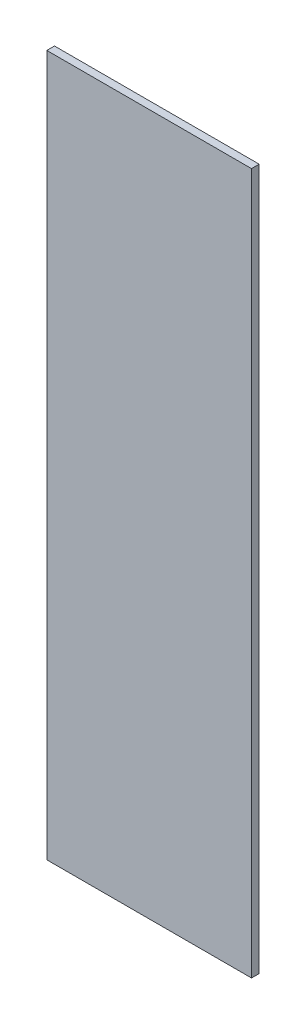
from build123d import *

# Parameters (mm, degrees)
CROQUIS1_W              = 400
CROQUIS1_H              = 1370
SALIENTE_EXTRUIR1_DEPTH = 15


with BuildPart() as part:
    # Croquis1 → Saliente-Extruir1 (new body)
    with BuildSketch(Plane.XY):
        Rectangle(CROQUIS1_W, CROQUIS1_H)
    extrude(amount=SALIENTE_EXTRUIR1_DEPTH)


solid = part.part
